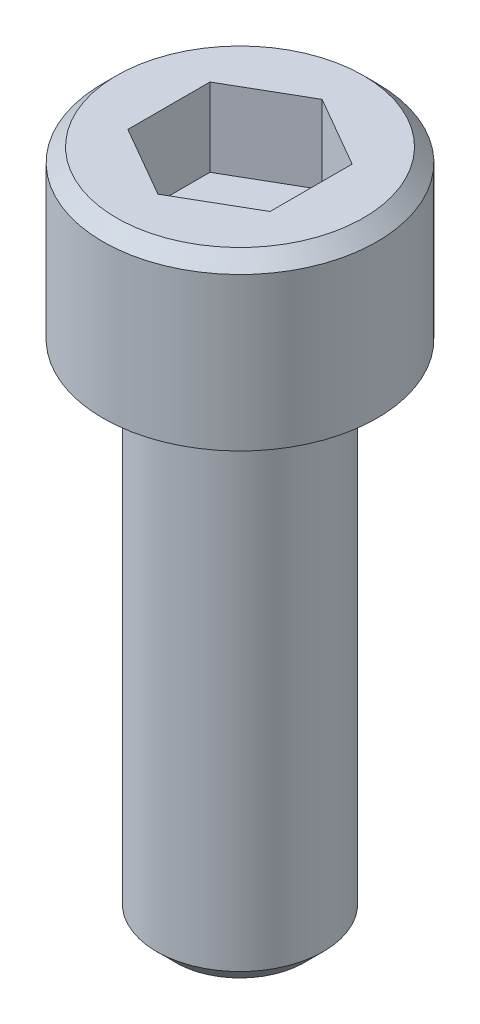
ISO-10303-21;
HEADER;
FILE_DESCRIPTION(('STEP AP214'),'2;1');
FILE_NAME('part.step','',(''),(''),'','','');
FILE_SCHEMA(('AUTOMOTIVE_DESIGN { 1 0 10303 214 1 1 1 1 }'));
ENDSEC;
DATA;
#1=APPLICATION_CONTEXT('core data for automotive mechanical design processes');
#2=APPLICATION_PROTOCOL_DEFINITION('international standard','automotive_design',2000,#1);
#3=PRODUCT_CONTEXT('',#1,'mechanical');
#4=PRODUCT('Part','Part','',(#3));
#5=PRODUCT_RELATED_PRODUCT_CATEGORY('part','',(#4));
#6=PRODUCT_DEFINITION_FORMATION('','',#4);
#7=PRODUCT_DEFINITION_CONTEXT('part definition',#1,'design');
#8=PRODUCT_DEFINITION('design','',#6,#7);
#9=PRODUCT_DEFINITION_SHAPE('','',#8);
#10=(LENGTH_UNIT() NAMED_UNIT(*) SI_UNIT(.MILLI.,.METRE.));
#11=(NAMED_UNIT(*) PLANE_ANGLE_UNIT() SI_UNIT($,.RADIAN.));
#12=(NAMED_UNIT(*) SI_UNIT($,.STERADIAN.) SOLID_ANGLE_UNIT());
#13=UNCERTAINTY_MEASURE_WITH_UNIT(LENGTH_MEASURE(1.E-05),#10,'distance_accuracy_value','');
#14=(GEOMETRIC_REPRESENTATION_CONTEXT(3) GLOBAL_UNCERTAINTY_ASSIGNED_CONTEXT((#13)) GLOBAL_UNIT_ASSIGNED_CONTEXT((#10,
#11,#12)) REPRESENTATION_CONTEXT('',''));
#15=CARTESIAN_POINT('',(0.,0.,0.));
#16=DIRECTION('',(0.,0.,1.));
#17=DIRECTION('',(1.,0.,0.));
#18=AXIS2_PLACEMENT_3D('',#15,#16,#17);
#19=CARTESIAN_POINT('',(2.0122792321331E-13,-1.62092561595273E-11,-1.59594559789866E-13));
#20=DIRECTION('',(0.,-1.00000000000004,0.));
#21=DIRECTION('',(0.,0.,-1.00000000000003));
#22=AXIS2_PLACEMENT_3D('',#19,#20,#21);
#23=PLANE('',#22);
#24=CARTESIAN_POINT('',(2.0122792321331E-13,-1.62092561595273E-11,-1.59594559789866E-13));
#25=DIRECTION('',(0.,-1.00000000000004,0.));
#26=DIRECTION('',(0.,0.,-1.00000000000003));
#27=AXIS2_PLACEMENT_3D('',#24,#25,#26);
#28=CIRCLE('',#27,2.0828);
#29=CARTESIAN_POINT('',(2.20883166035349E-13,-1.61716801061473E-11,-2.08280000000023));
#30=VERTEX_POINT('',#29);
#31=EDGE_CURVE('E11',#30,#30,#28,.T.);
#32=ORIENTED_EDGE('',*,*,#31,.F.);
#33=EDGE_LOOP('',(#32));
#34=FACE_BOUND('',#33,.T.);
#35=CARTESIAN_POINT('',(2.0122792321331E-13,-1.62092561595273E-11,-1.59594559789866E-13));
#36=DIRECTION('',(0.,-1.00000000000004,0.));
#37=DIRECTION('',(0.,0.,-1.00000000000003));
#38=AXIS2_PLACEMENT_3D('',#35,#36,#37);
#39=CIRCLE('',#38,3.429);
#40=CARTESIAN_POINT('',(2.33587164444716E-13,-1.61473931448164E-11,-3.42900000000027));
#41=VERTEX_POINT('',#40);
#42=EDGE_CURVE('E39',#41,#41,#39,.T.);
#43=ORIENTED_EDGE('',*,*,#42,.T.);
#44=EDGE_LOOP('',(#43));
#45=FACE_BOUND('',#44,.T.);
#46=ADVANCED_FACE('F32',(#34,#45),#23,.T.);
#47=CARTESIAN_POINT('',(2.0122792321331E-13,-1.62092561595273E-11,-1.59594559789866E-13));
#48=DIRECTION('',(0.,-1.00000000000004,0.));
#49=DIRECTION('',(0.,0.,-1.00000000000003));
#50=AXIS2_PLACEMENT_3D('',#47,#48,#49);
#51=CYLINDRICAL_SURFACE('',#50,3.429);
#52=CARTESIAN_POINT('',(5.43835809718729E-13,3.82269999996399,-2.56739074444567E-13));
#53=DIRECTION('',(0.,-1.00000000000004,0.));
#54=DIRECTION('',(0.,0.,-1.00000000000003));
#55=AXIS2_PLACEMENT_3D('',#52,#53,#54);
#56=CIRCLE('',#55,3.429);
#57=CARTESIAN_POINT('',(5.76195050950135E-13,3.82269999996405,-3.42900000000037));
#58=VERTEX_POINT('',#57);
#59=EDGE_CURVE('E149',#58,#58,#56,.T.);
#60=ORIENTED_EDGE('',*,*,#59,.T.);
#61=EDGE_LOOP('',(#60));
#62=FACE_BOUND('',#61,.T.);
#63=ORIENTED_EDGE('',*,*,#42,.F.);
#64=EDGE_LOOP('',(#63));
#65=FACE_BOUND('',#64,.T.);
#66=ADVANCED_FACE('F155',(#62,#65),#51,.T.);
#67=CARTESIAN_POINT('',(5.43835809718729E-13,3.82269999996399,-2.56739074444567E-13));
#68=DIRECTION('',(0.,-1.00000000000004,0.));
#69=DIRECTION('',(0.,0.,-1.00000000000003));
#70=AXIS2_PLACEMENT_3D('',#67,#68,#69);
#71=CONICAL_SURFACE('',#70,3.429,0.785398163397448);
#72=CARTESIAN_POINT('',(0.,4.16559999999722,4.09394740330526E-13));
#73=DIRECTION('',(0.,-1.00000000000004,0.));
#74=DIRECTION('',(0.,0.,-1.00000000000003));
#75=AXIS2_PLACEMENT_3D('',#72,#73,#74);
#76=CIRCLE('',#75,3.0861);
#77=CARTESIAN_POINT('',(1.21063661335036E-13,4.16559999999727,-3.08609999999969));
#78=VERTEX_POINT('',#77);
#79=EDGE_CURVE('E146',#78,#78,#76,.T.);
#80=ORIENTED_EDGE('',*,*,#79,.T.);
#81=EDGE_LOOP('',(#80));
#82=FACE_BOUND('',#81,.T.);
#83=ORIENTED_EDGE('',*,*,#59,.F.);
#84=EDGE_LOOP('',(#83));
#85=FACE_BOUND('',#84,.T.);
#86=ADVANCED_FACE('F157',(#82,#85),#71,.T.);
#87=CARTESIAN_POINT('',(3.08610000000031,4.16560000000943,4.09394740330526E-13));
#88=DIRECTION('',(0.,1.00000000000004,0.));
#89=DIRECTION('',(0.,0.,1.00000000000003));
#90=AXIS2_PLACEMENT_3D('',#87,#88,#89);
#91=PLANE('',#90);
#92=DIRECTION('',(1.01971764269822E-11,0.,1.00000000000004));
#93=VECTOR('',#92,1.);
#94=CARTESIAN_POINT('',(-1.77800000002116,4.16559999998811,-1.02652877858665));
#95=LINE('',#94,#93);
#96=CARTESIAN_POINT('',(-1.77800000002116,4.16559999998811,-1.02652877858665));
#97=VERTEX_POINT('',#96);
#98=CARTESIAN_POINT('',(-1.77799999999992,4.16560000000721,1.02652877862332));
#99=VERTEX_POINT('',#98);
#100=EDGE_CURVE('E46',#97,#99,#95,.T.);
#101=ORIENTED_EDGE('',*,*,#100,.F.);
#102=DIRECTION('',(-0.866025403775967,0.,0.500000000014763));
#103=VECTOR('',#102,1.);
#104=CARTESIAN_POINT('',(-3.1116602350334E-11,4.16559999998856,-2.05305755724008));
#105=LINE('',#104,#103);
#106=CARTESIAN_POINT('',(-3.1116602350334E-11,4.16559999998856,-2.05305755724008));
#107=VERTEX_POINT('',#106);
#108=EDGE_CURVE('E116',#107,#97,#105,.T.);
#109=ORIENTED_EDGE('',*,*,#108,.F.);
#110=DIRECTION('',(-0.866025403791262,0.,-0.499999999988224));
#111=VECTOR('',#110,1.);
#112=CARTESIAN_POINT('',(1.77799999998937,4.16559999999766,-1.02652877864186));
#113=LINE('',#112,#111);
#114=CARTESIAN_POINT('',(1.77799999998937,4.16559999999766,-1.02652877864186));
#115=VERTEX_POINT('',#114);
#116=EDGE_CURVE('E110',#115,#107,#113,.T.);
#117=ORIENTED_EDGE('',*,*,#116,.F.);
#118=DIRECTION('',(-1.01971764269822E-11,0.,-1.00000000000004));
#119=VECTOR('',#118,1.);
#120=CARTESIAN_POINT('',(1.77800000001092,4.165599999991,1.02652877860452));
#121=LINE('',#120,#119);
#122=CARTESIAN_POINT('',(1.77800000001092,4.165599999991,1.02652877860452));
#123=VERTEX_POINT('',#122);
#124=EDGE_CURVE('E108',#123,#115,#121,.T.);
#125=ORIENTED_EDGE('',*,*,#124,.F.);
#126=DIRECTION('',(0.866025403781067,0.,-0.500000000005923));
#127=VECTOR('',#126,1.);
#128=CARTESIAN_POINT('',(1.0922686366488E-11,4.16559999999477,2.05305755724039));
#129=LINE('',#128,#127);
#130=CARTESIAN_POINT('',(1.0922686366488E-11,4.16559999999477,2.05305755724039));
#131=VERTEX_POINT('',#130);
#132=EDGE_CURVE('E89',#131,#123,#129,.T.);
#133=ORIENTED_EDGE('',*,*,#132,.F.);
#134=DIRECTION('',(0.866025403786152,0.,0.49999999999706));
#135=VECTOR('',#134,1.);
#136=CARTESIAN_POINT('',(-1.77799999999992,4.16560000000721,1.02652877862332));
#137=LINE('',#136,#135);
#138=EDGE_CURVE('E100',#99,#131,#137,.T.);
#139=ORIENTED_EDGE('',*,*,#138,.F.);
#140=EDGE_LOOP('',(#101,#109,#117,#125,#133,#139));
#141=FACE_BOUND('',#140,.T.);
#142=ORIENTED_EDGE('',*,*,#79,.F.);
#143=EDGE_LOOP('',(#142));
#144=FACE_BOUND('',#143,.T.);
#145=ADVANCED_FACE('F104',(#141,#144),#91,.T.);
#146=CARTESIAN_POINT('',(4.22405166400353E-13,-12.7000000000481,4.09394740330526E-13));
#147=DIRECTION('',(0.,-1.00000000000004,0.));
#148=DIRECTION('',(0.,0.,-1.00000000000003));
#149=AXIS2_PLACEMENT_3D('',#146,#147,#148);
#150=PLANE('',#149);
#151=CARTESIAN_POINT('',(4.22405166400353E-13,-12.7000000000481,4.09394740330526E-13));
#152=DIRECTION('',(0.,-1.00000000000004,0.));
#153=DIRECTION('',(0.,0.,-1.00000000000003));
#154=AXIS2_PLACEMENT_3D('',#151,#152,#153);
#155=CIRCLE('',#154,1.61036);
#156=CARTESIAN_POINT('',(4.37602024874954E-13,-12.7000000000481,-1.61035999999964));
#157=VERTEX_POINT('',#156);
#158=EDGE_CURVE('E143',#157,#157,#155,.T.);
#159=ORIENTED_EDGE('',*,*,#158,.T.);
#160=EDGE_LOOP('',(#159));
#161=FACE_BOUND('',#160,.T.);
#162=ADVANCED_FACE('F169',(#161),#150,.T.);
#163=CARTESIAN_POINT('',(4.22405166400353E-13,-12.7000000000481,4.09394740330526E-13));
#164=DIRECTION('',(0.,1.00000000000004,0.));
#165=DIRECTION('',(0.,0.,1.00000000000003));
#166=AXIS2_PLACEMENT_3D('',#163,#164,#165);
#167=CONICAL_SURFACE('',#166,1.61036,0.785398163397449);
#168=CARTESIAN_POINT('',(4.562322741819E-13,-12.2275600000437,0.));
#169=DIRECTION('',(0.,-1.00000000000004,0.));
#170=DIRECTION('',(0.,0.,-1.00000000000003));
#171=AXIS2_PLACEMENT_3D('',#168,#169,#170);
#172=CIRCLE('',#171,2.0828);
#173=CARTESIAN_POINT('',(4.7588751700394E-13,-12.2275600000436,-2.08280000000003));
#174=VERTEX_POINT('',#173);
#175=EDGE_CURVE('E134',#174,#174,#172,.T.);
#176=ORIENTED_EDGE('',*,*,#175,.T.);
#177=EDGE_LOOP('',(#176));
#178=FACE_BOUND('',#177,.T.);
#179=ORIENTED_EDGE('',*,*,#158,.F.);
#180=EDGE_LOOP('',(#179));
#181=FACE_BOUND('',#180,.T.);
#182=ADVANCED_FACE('F172',(#178,#181),#167,.T.);
#183=CARTESIAN_POINT('',(2.0122792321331E-13,-1.62092561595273E-11,-1.59594559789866E-13));
#184=DIRECTION('',(0.,-1.00000000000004,0.));
#185=DIRECTION('',(0.,0.,-1.00000000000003));
#186=AXIS2_PLACEMENT_3D('',#183,#184,#185);
#187=CYLINDRICAL_SURFACE('',#186,2.0828);
#188=ORIENTED_EDGE('',*,*,#31,.T.);
#189=EDGE_LOOP('',(#188));
#190=FACE_BOUND('',#189,.T.);
#191=ORIENTED_EDGE('',*,*,#175,.F.);
#192=EDGE_LOOP('',(#191));
#193=FACE_BOUND('',#192,.T.);
#194=ADVANCED_FACE('F176',(#190,#193),#187,.T.);
#195=CARTESIAN_POINT('',(-1.77800000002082,2.20979999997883,-1.02652877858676));
#196=DIRECTION('',(-1.00000000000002,0.,1.0219380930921E-11));
#197=DIRECTION('',(1.01971764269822E-11,0.,1.00000000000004));
#198=AXIS2_PLACEMENT_3D('',#195,#196,#197);
#199=PLANE('',#198);
#200=ORIENTED_EDGE('',*,*,#100,.T.);
#201=DIRECTION('',(0.,1.00000000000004,0.));
#202=VECTOR('',#201,1.);
#203=CARTESIAN_POINT('',(-1.7779999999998,2.20979999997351,1.02652877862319));
#204=LINE('',#203,#202);
#205=CARTESIAN_POINT('',(-1.7779999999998,2.20979999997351,1.02652877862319));
#206=VERTEX_POINT('',#205);
#207=EDGE_CURVE('E97',#206,#99,#204,.T.);
#208=ORIENTED_EDGE('',*,*,#207,.F.);
#209=DIRECTION('',(1.01971764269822E-11,0.,1.00000000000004));
#210=VECTOR('',#209,1.);
#211=CARTESIAN_POINT('',(-1.77800000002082,2.20979999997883,-1.02652877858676));
#212=LINE('',#211,#210);
#213=CARTESIAN_POINT('',(-1.77800000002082,2.20979999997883,-1.02652877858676));
#214=VERTEX_POINT('',#213);
#215=EDGE_CURVE('E118',#214,#206,#212,.T.);
#216=ORIENTED_EDGE('',*,*,#215,.F.);
#217=DIRECTION('',(0.,1.00000000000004,0.));
#218=VECTOR('',#217,1.);
#219=CARTESIAN_POINT('',(-1.77800000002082,2.20979999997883,-1.02652877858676));
#220=LINE('',#219,#218);
#221=EDGE_CURVE('E53',#214,#97,#220,.T.);
#222=ORIENTED_EDGE('',*,*,#221,.T.);
#223=EDGE_LOOP('',(#200,#208,#216,#222));
#224=FACE_BOUND('',#223,.T.);
#225=ADVANCED_FACE('F180',(#224),#199,.F.);
#226=CARTESIAN_POINT('',(-3.12805337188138E-11,2.20979999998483,-2.05305755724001));
#227=DIRECTION('',(-0.500000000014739,0.,-0.866025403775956));
#228=DIRECTION('',(-0.866025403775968,0.,0.500000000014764));
#229=AXIS2_PLACEMENT_3D('',#226,#227,#228);
#230=PLANE('',#229);
#231=ORIENTED_EDGE('',*,*,#108,.T.);
#232=ORIENTED_EDGE('',*,*,#221,.F.);
#233=DIRECTION('',(-0.866025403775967,0.,0.500000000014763));
#234=VECTOR('',#233,1.);
#235=CARTESIAN_POINT('',(-3.12805337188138E-11,2.20979999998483,-2.05305755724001));
#236=LINE('',#235,#234);
#237=CARTESIAN_POINT('',(-3.12805337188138E-11,2.20979999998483,-2.05305755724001));
#238=VERTEX_POINT('',#237);
#239=EDGE_CURVE('E130',#238,#214,#236,.T.);
#240=ORIENTED_EDGE('',*,*,#239,.F.);
#241=DIRECTION('',(0.,1.00000000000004,0.));
#242=VECTOR('',#241,1.);
#243=CARTESIAN_POINT('',(-3.12805337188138E-11,2.20979999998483,-2.05305755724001));
#244=LINE('',#243,#242);
#245=EDGE_CURVE('E135',#238,#107,#244,.T.);
#246=ORIENTED_EDGE('',*,*,#245,.T.);
#247=EDGE_LOOP('',(#231,#232,#240,#246));
#248=FACE_BOUND('',#247,.T.);
#249=ADVANCED_FACE('F184',(#248),#230,.F.);
#250=CARTESIAN_POINT('',(1.77799999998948,2.20979999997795,-1.02652877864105));
#251=DIRECTION('',(0.499999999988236,0.,-0.866025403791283));
#252=DIRECTION('',(-0.866025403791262,0.,-0.499999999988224));
#253=AXIS2_PLACEMENT_3D('',#250,#251,#252);
#254=PLANE('',#253);
#255=ORIENTED_EDGE('',*,*,#116,.T.);
#256=ORIENTED_EDGE('',*,*,#245,.F.);
#257=DIRECTION('',(-0.866025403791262,0.,-0.499999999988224));
#258=VECTOR('',#257,1.);
#259=CARTESIAN_POINT('',(1.77799999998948,2.20979999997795,-1.02652877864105));
#260=LINE('',#259,#258);
#261=CARTESIAN_POINT('',(1.77799999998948,2.20979999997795,-1.02652877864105));
#262=VERTEX_POINT('',#261);
#263=EDGE_CURVE('E127',#262,#238,#260,.T.);
#264=ORIENTED_EDGE('',*,*,#263,.F.);
#265=DIRECTION('',(0.,1.00000000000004,0.));
#266=VECTOR('',#265,1.);
#267=CARTESIAN_POINT('',(1.77799999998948,2.20979999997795,-1.02652877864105));
#268=LINE('',#267,#266);
#269=EDGE_CURVE('E137',#262,#115,#268,.T.);
#270=ORIENTED_EDGE('',*,*,#269,.T.);
#271=EDGE_LOOP('',(#255,#256,#264,#270));
#272=FACE_BOUND('',#271,.T.);
#273=ADVANCED_FACE('F193',(#272),#254,.F.);
#274=CARTESIAN_POINT('',(1.77800000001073,2.20979999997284,1.0265287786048));
#275=DIRECTION('',(1.00000000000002,0.,-1.0219380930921E-11));
#276=DIRECTION('',(-1.01971764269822E-11,0.,-1.00000000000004));
#277=AXIS2_PLACEMENT_3D('',#274,#275,#276);
#278=PLANE('',#277);
#279=ORIENTED_EDGE('',*,*,#124,.T.);
#280=ORIENTED_EDGE('',*,*,#269,.F.);
#281=DIRECTION('',(-1.01971764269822E-11,0.,-1.00000000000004));
#282=VECTOR('',#281,1.);
#283=CARTESIAN_POINT('',(1.77800000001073,2.20979999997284,1.0265287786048));
#284=LINE('',#283,#282);
#285=CARTESIAN_POINT('',(1.77800000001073,2.20979999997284,1.0265287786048));
#286=VERTEX_POINT('',#285);
#287=EDGE_CURVE('E124',#286,#262,#284,.T.);
#288=ORIENTED_EDGE('',*,*,#287,.F.);
#289=DIRECTION('',(0.,1.00000000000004,0.));
#290=VECTOR('',#289,1.);
#291=CARTESIAN_POINT('',(1.77800000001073,2.20979999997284,1.0265287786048));
#292=LINE('',#291,#290);
#293=EDGE_CURVE('E96',#286,#123,#292,.T.);
#294=ORIENTED_EDGE('',*,*,#293,.T.);
#295=EDGE_LOOP('',(#279,#280,#288,#294));
#296=FACE_BOUND('',#295,.T.);
#297=ADVANCED_FACE('F190',(#296),#278,.F.);
#298=CARTESIAN_POINT('',(1.01177746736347E-11,2.20979999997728,2.05305755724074));
#299=DIRECTION('',(0.500000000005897,0.,0.866025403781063));
#300=DIRECTION('',(0.866025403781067,0.,-0.500000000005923));
#301=AXIS2_PLACEMENT_3D('',#298,#299,#300);
#302=PLANE('',#301);
#303=ORIENTED_EDGE('',*,*,#132,.T.);
#304=ORIENTED_EDGE('',*,*,#293,.F.);
#305=DIRECTION('',(0.866025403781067,0.,-0.500000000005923));
#306=VECTOR('',#305,1.);
#307=CARTESIAN_POINT('',(1.01177746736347E-11,2.20979999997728,2.05305755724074));
#308=LINE('',#307,#306);
#309=CARTESIAN_POINT('',(1.01177746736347E-11,2.20979999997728,2.05305755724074));
#310=VERTEX_POINT('',#309);
#311=EDGE_CURVE('E92',#310,#286,#308,.T.);
#312=ORIENTED_EDGE('',*,*,#311,.F.);
#313=DIRECTION('',(0.,1.00000000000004,0.));
#314=VECTOR('',#313,1.);
#315=CARTESIAN_POINT('',(1.01177746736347E-11,2.20979999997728,2.05305755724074));
#316=LINE('',#315,#314);
#317=EDGE_CURVE('E85',#310,#131,#316,.T.);
#318=ORIENTED_EDGE('',*,*,#317,.T.);
#319=EDGE_LOOP('',(#303,#304,#312,#318));
#320=FACE_BOUND('',#319,.T.);
#321=ADVANCED_FACE('F87',(#320),#302,.F.);
#322=CARTESIAN_POINT('',(-1.7779999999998,2.20979999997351,1.02652877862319));
#323=DIRECTION('',(-0.499999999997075,0.,0.866025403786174));
#324=DIRECTION('',(0.866025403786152,0.,0.49999999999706));
#325=AXIS2_PLACEMENT_3D('',#322,#323,#324);
#326=PLANE('',#325);
#327=ORIENTED_EDGE('',*,*,#138,.T.);
#328=ORIENTED_EDGE('',*,*,#317,.F.);
#329=DIRECTION('',(0.866025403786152,0.,0.49999999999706));
#330=VECTOR('',#329,1.);
#331=CARTESIAN_POINT('',(-1.7779999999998,2.20979999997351,1.02652877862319));
#332=LINE('',#331,#330);
#333=EDGE_CURVE('E121',#206,#310,#332,.T.);
#334=ORIENTED_EDGE('',*,*,#333,.F.);
#335=ORIENTED_EDGE('',*,*,#207,.T.);
#336=EDGE_LOOP('',(#327,#328,#334,#335));
#337=FACE_BOUND('',#336,.T.);
#338=ADVANCED_FACE('F101',(#337),#326,.F.);
#339=CARTESIAN_POINT('',(-1.77799999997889,2.20979999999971,3.0795863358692));
#340=DIRECTION('',(0.,1.00000000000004,0.));
#341=DIRECTION('',(0.,0.,1.00000000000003));
#342=AXIS2_PLACEMENT_3D('',#339,#340,#341);
#343=PLANE('',#342);
#344=ORIENTED_EDGE('',*,*,#215,.T.);
#345=ORIENTED_EDGE('',*,*,#333,.T.);
#346=ORIENTED_EDGE('',*,*,#311,.T.);
#347=ORIENTED_EDGE('',*,*,#287,.T.);
#348=ORIENTED_EDGE('',*,*,#263,.T.);
#349=ORIENTED_EDGE('',*,*,#239,.T.);
#350=EDGE_LOOP('',(#344,#345,#346,#347,#348,#349));
#351=FACE_BOUND('',#350,.T.);
#352=ADVANCED_FACE('F187',(#351),#343,.T.);
#353=CLOSED_SHELL('',(#46,#66,#86,#145,#162,#182,#194,#225,#249,#273,#297,#321,#338,#352));
#354=MANIFOLD_SOLID_BREP('B2',#353);
#355=ADVANCED_BREP_SHAPE_REPRESENTATION('',(#18,#354),#14);
#356=SHAPE_DEFINITION_REPRESENTATION(#9,#355);
ENDSEC;
END-ISO-10303-21;
